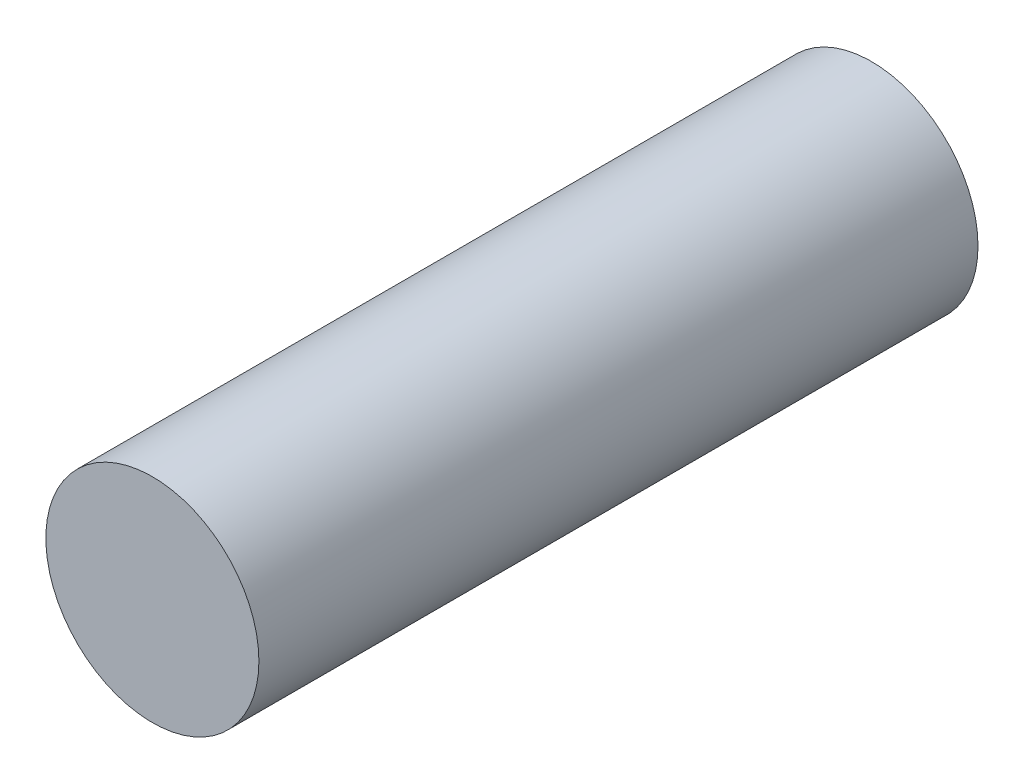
ISO-10303-21;
HEADER;
FILE_DESCRIPTION(('STEP AP214'),'2;1');
FILE_NAME('part.step','',(''),(''),'','','');
FILE_SCHEMA(('AUTOMOTIVE_DESIGN { 1 0 10303 214 1 1 1 1 }'));
ENDSEC;
DATA;
#1=APPLICATION_CONTEXT('core data for automotive mechanical design processes');
#2=APPLICATION_PROTOCOL_DEFINITION('international standard','automotive_design',2000,#1);
#3=PRODUCT_CONTEXT('',#1,'mechanical');
#4=PRODUCT('Part','Part','',(#3));
#5=PRODUCT_RELATED_PRODUCT_CATEGORY('part','',(#4));
#6=PRODUCT_DEFINITION_FORMATION('','',#4);
#7=PRODUCT_DEFINITION_CONTEXT('part definition',#1,'design');
#8=PRODUCT_DEFINITION('design','',#6,#7);
#9=PRODUCT_DEFINITION_SHAPE('','',#8);
#10=(LENGTH_UNIT() NAMED_UNIT(*) SI_UNIT(.MILLI.,.METRE.));
#11=(NAMED_UNIT(*) PLANE_ANGLE_UNIT() SI_UNIT($,.RADIAN.));
#12=(NAMED_UNIT(*) SI_UNIT($,.STERADIAN.) SOLID_ANGLE_UNIT());
#13=UNCERTAINTY_MEASURE_WITH_UNIT(LENGTH_MEASURE(1.E-05),#10,'distance_accuracy_value','');
#14=(GEOMETRIC_REPRESENTATION_CONTEXT(3) GLOBAL_UNCERTAINTY_ASSIGNED_CONTEXT((#13)) GLOBAL_UNIT_ASSIGNED_CONTEXT((#10,
#11,#12)) REPRESENTATION_CONTEXT('',''));
#15=CARTESIAN_POINT('',(0.,0.,0.));
#16=DIRECTION('',(0.,0.,1.));
#17=DIRECTION('',(1.,0.,0.));
#18=AXIS2_PLACEMENT_3D('',#15,#16,#17);
#19=CARTESIAN_POINT('',(0.,0.,-6.75));
#20=DIRECTION('',(0.,0.,1.));
#21=DIRECTION('',(1.,0.,0.));
#22=AXIS2_PLACEMENT_3D('',#19,#20,#21);
#23=CYLINDRICAL_SURFACE('',#22,2.);
#24=CARTESIAN_POINT('',(0.,0.,-6.75));
#25=DIRECTION('',(0.,0.,1.));
#26=DIRECTION('',(1.,0.,0.));
#27=AXIS2_PLACEMENT_3D('',#24,#25,#26);
#28=CIRCLE('',#27,2.);
#29=CARTESIAN_POINT('',(2.,0.,-6.75));
#30=VERTEX_POINT('',#29);
#31=EDGE_CURVE('E10',#30,#30,#28,.T.);
#32=ORIENTED_EDGE('',*,*,#31,.T.);
#33=EDGE_LOOP('',(#32));
#34=FACE_BOUND('',#33,.T.);
#35=CARTESIAN_POINT('',(0.,0.,6.75));
#36=DIRECTION('',(0.,0.,1.));
#37=DIRECTION('',(1.,0.,0.));
#38=AXIS2_PLACEMENT_3D('',#35,#36,#37);
#39=CIRCLE('',#38,2.);
#40=CARTESIAN_POINT('',(2.,0.,6.75));
#41=VERTEX_POINT('',#40);
#42=EDGE_CURVE('E42',#41,#41,#39,.T.);
#43=ORIENTED_EDGE('',*,*,#42,.F.);
#44=EDGE_LOOP('',(#43));
#45=FACE_BOUND('',#44,.T.);
#46=ADVANCED_FACE('F39',(#34,#45),#23,.T.);
#47=CARTESIAN_POINT('',(0.,0.,-6.75));
#48=DIRECTION('',(0.,0.,1.));
#49=DIRECTION('',(1.,0.,0.));
#50=AXIS2_PLACEMENT_3D('',#47,#48,#49);
#51=PLANE('',#50);
#52=ORIENTED_EDGE('',*,*,#31,.F.);
#53=EDGE_LOOP('',(#52));
#54=FACE_BOUND('',#53,.T.);
#55=ADVANCED_FACE('F54',(#54),#51,.F.);
#56=CARTESIAN_POINT('',(0.,0.,6.75));
#57=DIRECTION('',(0.,0.,1.));
#58=DIRECTION('',(1.,0.,0.));
#59=AXIS2_PLACEMENT_3D('',#56,#57,#58);
#60=PLANE('',#59);
#61=ORIENTED_EDGE('',*,*,#42,.T.);
#62=EDGE_LOOP('',(#61));
#63=FACE_BOUND('',#62,.T.);
#64=ADVANCED_FACE('F51',(#63),#60,.T.);
#65=CLOSED_SHELL('',(#46,#55,#64));
#66=MANIFOLD_SOLID_BREP('B2',#65);
#67=ADVANCED_BREP_SHAPE_REPRESENTATION('',(#18,#66),#14);
#68=SHAPE_DEFINITION_REPRESENTATION(#9,#67);
ENDSEC;
END-ISO-10303-21;
